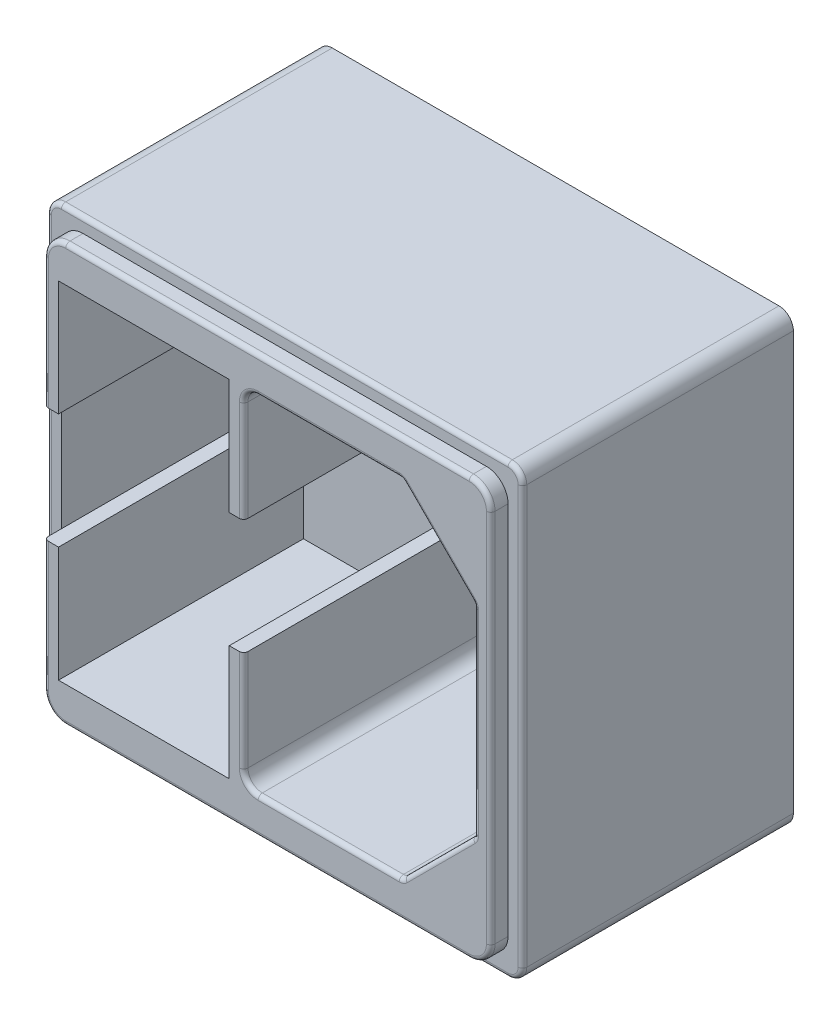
from build123d import *

# Parameters (mm, degrees)
EXTRUSION1_DEPTH        = 20
ENL_V_MAT_EXTRU_1_DEPTH = 17
ENL_V_MAT_EXTRU_2_REACH = 50.363
ESQUISSE3_W             = 4
ESQUISSE3_H             = 1.6
ENL_V_MAT_EXTRU_3_DEPTH = 17
ESQUISSE6_OUTSIDE_W     = 44.9
ESQUISSE6_OUTSIDE_H     = 42.9
ENL_V_MAT_EXTRU_4_DEPTH = 1.2
CONG_1_R                = 0.3
CONG_2_R                = 0.3
CONG_3_R                = 0.3


with BuildPart() as part:
    # Esquisse1 → Extrusion1 (new body)
    with BuildSketch(Plane.XY):
        with BuildLine():
            Line((1, 0), (32, 0))
            ThreePointArc((32, 0), (32.707106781, 0.292893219), (33, 1))
            Line((33, 1), (33, 30))
            ThreePointArc((33, 30), (32.707106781, 30.707106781), (32, 31))
            Line((32, 31), (1, 31))
            ThreePointArc((1, 31), (0.292893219, 30.707106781), (0, 30))
            Line((0, 30), (0, 1))
            ThreePointArc((0, 1), (0.292893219, 0.292893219), (1, 0))
        make_face()
    extrude(amount=EXTRUSION1_DEPTH)

    # Esquisse2 → Enl_v. mat.-Extru.1 (cut)
    with BuildSketch(Plane.XY.offset(20)):
        with BuildLine():
            Line((30.849116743, 22.292893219), (30.849116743, 8.707106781))
            ThreePointArc((30.849116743, 8.707106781), (30.811056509, 8.515765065), (30.702670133, 8.353553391))
            Line((30.702670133, 8.353553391), (25.995563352, 3.646446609))
            ThreePointArc((25.995563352, 3.646446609), (25.833351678, 3.538060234), (25.642009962, 3.5))
            Line((25.642009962, 3.5), (15.849116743, 3.5))
            ThreePointArc((15.849116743, 3.5), (15.142009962, 3.792893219), (14.849116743, 4.5))
            Line((14.849116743, 4.5), (14.849116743, 26.5))
            ThreePointArc((14.849116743, 26.5), (15.142009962, 27.207106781), (15.849116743, 27.5))
            Line((15.849116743, 27.5), (25.642009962, 27.5))
            ThreePointArc((25.642009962, 27.5), (25.833351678, 27.461939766), (25.995563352, 27.353553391))
            Line((25.995563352, 27.353553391), (30.702670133, 22.646446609))
            ThreePointArc((30.702670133, 22.646446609), (30.811056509, 22.484234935), (30.849116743, 22.292893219))
        make_face()
    extrude(amount=-ENL_V_MAT_EXTRU_1_DEPTH, mode=Mode.SUBTRACT)

    # Esquisse3 → Enl_v. mat.-Extru.2 (cut, up to next)
    with BuildSketch(Plane.XY.offset(3), mode=Mode.PRIVATE) as enl_v_mat_extru_2_sk1:
        with Locations((20.400759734, 25.288698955)):
            Rectangle(ESQUISSE3_W, ESQUISSE3_H)
    enl_v_mat_extru_2_tool1 = extrude(enl_v_mat_extru_2_sk1.sketch, amount=-ENL_V_MAT_EXTRU_2_REACH, mode=Mode.PRIVATE) & part.part
    # Esquisse3 → Enl_v. mat.-Extru.2 (cut, up to next)
    with BuildSketch(Plane.XY.offset(3), mode=Mode.PRIVATE) as enl_v_mat_extru_2_sk2:
        with Locations((28.435897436, 15.5)):
            Rectangle(ESQUISSE3_W, ESQUISSE3_H)
    enl_v_mat_extru_2_tool2 = extrude(enl_v_mat_extru_2_sk2.sketch, amount=-ENL_V_MAT_EXTRU_2_REACH, mode=Mode.PRIVATE) & part.part
    # Esquisse3 → Enl_v. mat.-Extru.2 (cut, up to next)
    with BuildSketch(Plane.XY.offset(3), mode=Mode.PRIVATE) as enl_v_mat_extru_2_sk3:
        with Locations((20.400759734, 5.711301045)):
            Rectangle(ESQUISSE3_W, ESQUISSE3_H)
    enl_v_mat_extru_2_tool3 = extrude(enl_v_mat_extru_2_sk3.sketch, amount=-ENL_V_MAT_EXTRU_2_REACH, mode=Mode.PRIVATE) & part.part
    add(enl_v_mat_extru_2_tool1.solids().sort_by_distance((20.40076, 25.288699, 3))[0], mode=Mode.SUBTRACT)
    add(enl_v_mat_extru_2_tool2.solids().sort_by_distance((28.435897, 15.5, 3))[0], mode=Mode.SUBTRACT)
    add(enl_v_mat_extru_2_tool3.solids().sort_by_distance((20.40076, 5.711301, 3))[0], mode=Mode.SUBTRACT)

    # Esquisse4 → Enl_v. mat.-Extru.3 (cut)
    with BuildSketch(Plane.XY.offset(20)):
        Polygon((13.849116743, 27.5), (2, 27.5), (2, 19.5), (1, 19.5), (1, 11.5), (2, 11.5), (2, 3.5), (13.849116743, 3.5), (13.849116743, 11.5), (14.849116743, 11.5), (14.849116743, 19.5), (13.849116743, 19.5), align=None)
    extrude(amount=-ENL_V_MAT_EXTRU_3_DEPTH, mode=Mode.SUBTRACT)

    # Esquisse6 outside → Enl_v. mat.-Extru.4 (cut)
    with BuildSketch(Plane.XY.offset(20)):
        with Locations((16.5, 15.5)):
            Rectangle(ESQUISSE6_OUTSIDE_W, ESQUISSE6_OUTSIDE_H)
        with BuildLine():
            Line((30.5, 30), (2.5, 30))
            ThreePointArc((2.5, 30), (1.439339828, 29.560660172), (1, 28.5))
            Line((1, 28.5), (1, 2.5))
            ThreePointArc((1, 2.5), (1.439339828, 1.439339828), (2.5, 1))
            Line((2.5, 1), (30.5, 1))
            ThreePointArc((30.5, 1), (31.560660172, 1.439339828), (32, 2.5))
            Line((32, 2.5), (32, 28.5))
            ThreePointArc((32, 28.5), (31.560660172, 29.560660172), (30.5, 30))
        make_face(mode=Mode.SUBTRACT)
    extrude(amount=-ENL_V_MAT_EXTRU_4_DEPTH, mode=Mode.SUBTRACT)

    # Cong_1
    cong_1_edges = [part.edges().sort_by_distance(p)[0] for p in [
        (1, 7, 20),
        (1, 24, 20),
        (1.439339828, 29.560660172, 20),
        (16.5, 30, 20),
        (31.560660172, 29.560660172, 20),
        (32, 15.5, 20),
        (31.560660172, 1.439339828, 20),
        (16.5, 1, 20),
        (1.439339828, 1.439339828, 20),
    ]]
    fillet(cong_1_edges, radius=CONG_1_R)

    # Cong_2
    cong_2_edges = [part.edges().sort_by_distance(p)[0] for p in [
        (16.5, 31, 18.8),
        (0.292893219, 30.707106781, 18.8),
        (0, 15.5, 18.8),
        (0.292893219, 0.292893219, 18.8),
        (16.5, 0, 18.8),
        (32.707106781, 0.292893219, 18.8),
        (33, 15.5, 18.8),
        (32.707106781, 30.707106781, 18.8),
    ]]
    fillet(cong_2_edges, radius=CONG_2_R)

    # Cong_3
    cong_3_edges = [part.edges().sort_by_distance(p)[0] for p in [
        (15.142009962, 27.207106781, 20),
        (14.849116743, 23, 20),
        (15.142009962, 3.792893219, 20),
        (20.745563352, 3.5, 20),
        (25.833351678, 3.538060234, 20),
        (28.349116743, 6, 20),
        (30.811056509, 8.515765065, 20),
        (30.849116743, 15.5, 20),
        (30.811056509, 22.484234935, 20),
        (28.349116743, 25, 20),
        (25.833351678, 27.461939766, 20),
        (20.745563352, 27.5, 20),
        (14.849116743, 8, 20),
    ]]
    fillet(cong_3_edges, radius=CONG_3_R)


solid = part.part
